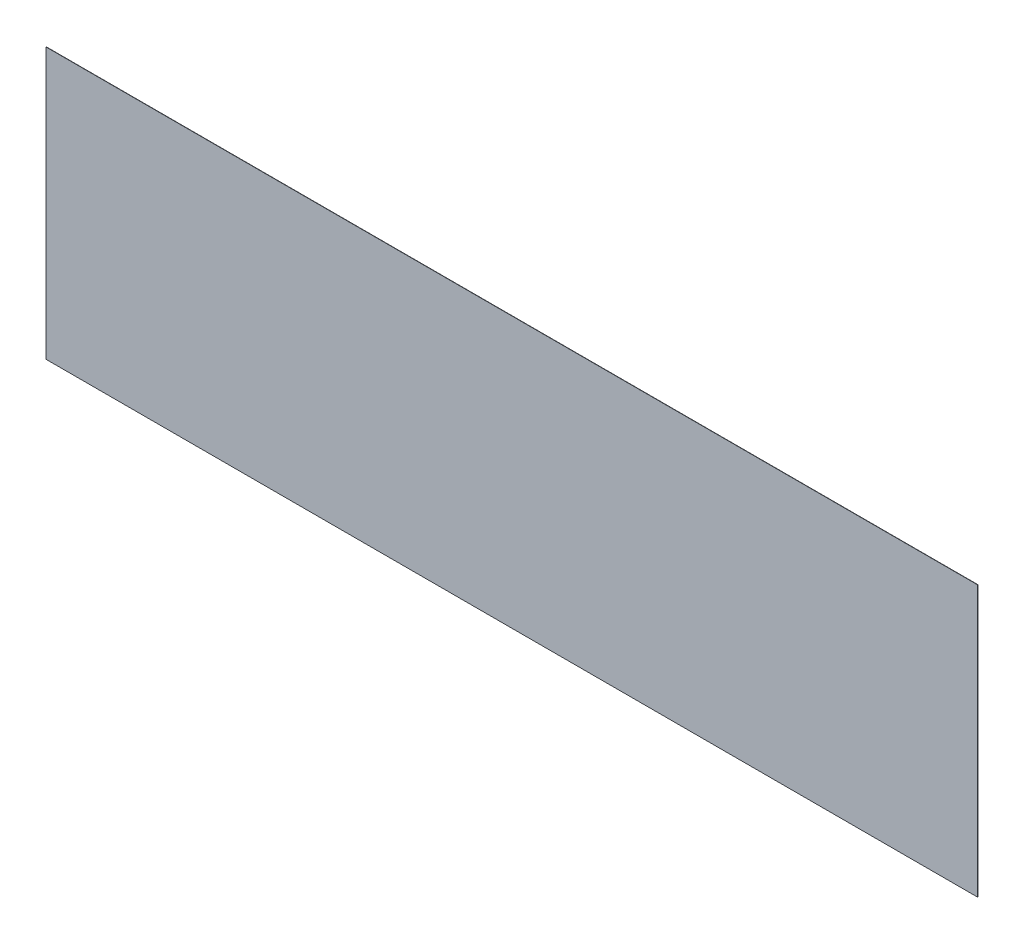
ISO-10303-21;
HEADER;
FILE_DESCRIPTION(('STEP AP214'),'2;1');
FILE_NAME('part.step','',(''),(''),'','','');
FILE_SCHEMA(('AUTOMOTIVE_DESIGN { 1 0 10303 214 1 1 1 1 }'));
ENDSEC;
DATA;
#1=APPLICATION_CONTEXT('core data for automotive mechanical design processes');
#2=APPLICATION_PROTOCOL_DEFINITION('international standard','automotive_design',2000,#1);
#3=PRODUCT_CONTEXT('',#1,'mechanical');
#4=PRODUCT('Part','Part','',(#3));
#5=PRODUCT_RELATED_PRODUCT_CATEGORY('part','',(#4));
#6=PRODUCT_DEFINITION_FORMATION('','',#4);
#7=PRODUCT_DEFINITION_CONTEXT('part definition',#1,'design');
#8=PRODUCT_DEFINITION('design','',#6,#7);
#9=PRODUCT_DEFINITION_SHAPE('','',#8);
#10=(LENGTH_UNIT() NAMED_UNIT(*) SI_UNIT(.MILLI.,.METRE.));
#11=(NAMED_UNIT(*) PLANE_ANGLE_UNIT() SI_UNIT($,.RADIAN.));
#12=(NAMED_UNIT(*) SI_UNIT($,.STERADIAN.) SOLID_ANGLE_UNIT());
#13=UNCERTAINTY_MEASURE_WITH_UNIT(LENGTH_MEASURE(1.E-05),#10,'distance_accuracy_value','');
#14=(GEOMETRIC_REPRESENTATION_CONTEXT(3) GLOBAL_UNCERTAINTY_ASSIGNED_CONTEXT((#13)) GLOBAL_UNIT_ASSIGNED_CONTEXT((#10,
#11,#12)) REPRESENTATION_CONTEXT('',''));
#15=CARTESIAN_POINT('',(0.,0.,0.));
#16=DIRECTION('',(0.,0.,1.));
#17=DIRECTION('',(1.,0.,0.));
#18=AXIS2_PLACEMENT_3D('',#15,#16,#17);
#19=CARTESIAN_POINT('',(0.,0.,0.01));
#20=DIRECTION('',(0.,0.,1.));
#21=DIRECTION('',(1.,0.,0.));
#22=AXIS2_PLACEMENT_3D('',#19,#20,#21);
#23=PLANE('',#22);
#24=DIRECTION('',(1.,0.,0.));
#25=VECTOR('',#24,1.);
#26=CARTESIAN_POINT('',(31.,9.,0.01));
#27=LINE('',#26,#25);
#28=CARTESIAN_POINT('',(0.,9.,0.01));
#29=VERTEX_POINT('',#28);
#30=CARTESIAN_POINT('',(31.,9.,0.01));
#31=VERTEX_POINT('',#30);
#32=EDGE_CURVE('E67',#29,#31,#27,.T.);
#33=ORIENTED_EDGE('',*,*,#32,.F.);
#34=DIRECTION('',(0.,1.,0.));
#35=VECTOR('',#34,1.);
#36=CARTESIAN_POINT('',(0.,9.,0.01));
#37=LINE('',#36,#35);
#38=CARTESIAN_POINT('',(0.,0.,0.01));
#39=VERTEX_POINT('',#38);
#40=EDGE_CURVE('E19',#39,#29,#37,.T.);
#41=ORIENTED_EDGE('',*,*,#40,.F.);
#42=DIRECTION('',(1.,0.,0.));
#43=VECTOR('',#42,1.);
#44=CARTESIAN_POINT('',(0.,0.,0.01));
#45=LINE('',#44,#43);
#46=CARTESIAN_POINT('',(31.,0.,0.01));
#47=VERTEX_POINT('',#46);
#48=EDGE_CURVE('E57',#47,#39,#45,.F.);
#49=ORIENTED_EDGE('',*,*,#48,.F.);
#50=DIRECTION('',(0.,1.,0.));
#51=VECTOR('',#50,1.);
#52=CARTESIAN_POINT('',(31.,0.,0.01));
#53=LINE('',#52,#51);
#54=EDGE_CURVE('E52',#31,#47,#53,.F.);
#55=ORIENTED_EDGE('',*,*,#54,.F.);
#56=EDGE_LOOP('',(#33,#41,#49,#55));
#57=FACE_BOUND('',#56,.T.);
#58=ADVANCED_FACE('F16',(#57),#23,.T.);
#59=CARTESIAN_POINT('',(0.,9.,0.));
#60=DIRECTION('',(-1.,0.,0.));
#61=DIRECTION('',(0.,0.,1.));
#62=AXIS2_PLACEMENT_3D('',#59,#60,#61);
#63=PLANE('',#62);
#64=DIRECTION('',(0.,0.,1.));
#65=VECTOR('',#64,1.);
#66=CARTESIAN_POINT('',(0.,9.,0.));
#67=LINE('',#66,#65);
#68=CARTESIAN_POINT('',(0.,9.,0.));
#69=VERTEX_POINT('',#68);
#70=EDGE_CURVE('E78',#69,#29,#67,.T.);
#71=ORIENTED_EDGE('',*,*,#70,.F.);
#72=DIRECTION('',(0.,1.,0.));
#73=VECTOR('',#72,1.);
#74=CARTESIAN_POINT('',(0.,0.,0.));
#75=LINE('',#74,#73);
#76=CARTESIAN_POINT('',(0.,0.,0.));
#77=VERTEX_POINT('',#76);
#78=EDGE_CURVE('E73',#69,#77,#75,.F.);
#79=ORIENTED_EDGE('',*,*,#78,.T.);
#80=DIRECTION('',(0.,0.,-1.));
#81=VECTOR('',#80,1.);
#82=CARTESIAN_POINT('',(0.,0.,0.));
#83=LINE('',#82,#81);
#84=EDGE_CURVE('E62',#39,#77,#83,.T.);
#85=ORIENTED_EDGE('',*,*,#84,.F.);
#86=ORIENTED_EDGE('',*,*,#40,.T.);
#87=EDGE_LOOP('',(#71,#79,#85,#86));
#88=FACE_BOUND('',#87,.T.);
#89=ADVANCED_FACE('F72',(#88),#63,.T.);
#90=CARTESIAN_POINT('',(0.,0.,0.));
#91=DIRECTION('',(0.,-1.,0.));
#92=DIRECTION('',(0.,0.,-1.));
#93=AXIS2_PLACEMENT_3D('',#90,#91,#92);
#94=PLANE('',#93);
#95=ORIENTED_EDGE('',*,*,#84,.T.);
#96=DIRECTION('',(1.,0.,0.));
#97=VECTOR('',#96,1.);
#98=CARTESIAN_POINT('',(0.,0.,0.));
#99=LINE('',#98,#97);
#100=CARTESIAN_POINT('',(31.,0.,0.));
#101=VERTEX_POINT('',#100);
#102=EDGE_CURVE('E83',#77,#101,#99,.T.);
#103=ORIENTED_EDGE('',*,*,#102,.T.);
#104=DIRECTION('',(0.,0.,-1.));
#105=VECTOR('',#104,1.);
#106=CARTESIAN_POINT('',(31.,0.,0.));
#107=LINE('',#106,#105);
#108=EDGE_CURVE('E64',#47,#101,#107,.T.);
#109=ORIENTED_EDGE('',*,*,#108,.F.);
#110=ORIENTED_EDGE('',*,*,#48,.T.);
#111=EDGE_LOOP('',(#95,#103,#109,#110));
#112=FACE_BOUND('',#111,.T.);
#113=ADVANCED_FACE('F59',(#112),#94,.T.);
#114=CARTESIAN_POINT('',(31.,0.,0.));
#115=DIRECTION('',(1.,0.,0.));
#116=DIRECTION('',(0.,0.,-1.));
#117=AXIS2_PLACEMENT_3D('',#114,#115,#116);
#118=PLANE('',#117);
#119=ORIENTED_EDGE('',*,*,#108,.T.);
#120=DIRECTION('',(0.,1.,0.));
#121=VECTOR('',#120,1.);
#122=CARTESIAN_POINT('',(31.,0.,0.));
#123=LINE('',#122,#121);
#124=CARTESIAN_POINT('',(31.,9.,0.));
#125=VERTEX_POINT('',#124);
#126=EDGE_CURVE('E25',#101,#125,#123,.T.);
#127=ORIENTED_EDGE('',*,*,#126,.T.);
#128=DIRECTION('',(0.,0.,1.));
#129=VECTOR('',#128,1.);
#130=CARTESIAN_POINT('',(31.,9.,0.));
#131=LINE('',#130,#129);
#132=EDGE_CURVE('E33',#31,#125,#131,.F.);
#133=ORIENTED_EDGE('',*,*,#132,.F.);
#134=ORIENTED_EDGE('',*,*,#54,.T.);
#135=EDGE_LOOP('',(#119,#127,#133,#134));
#136=FACE_BOUND('',#135,.T.);
#137=ADVANCED_FACE('F87',(#136),#118,.T.);
#138=CARTESIAN_POINT('',(31.,9.,0.));
#139=DIRECTION('',(0.,1.,0.));
#140=DIRECTION('',(0.,0.,1.));
#141=AXIS2_PLACEMENT_3D('',#138,#139,#140);
#142=PLANE('',#141);
#143=ORIENTED_EDGE('',*,*,#132,.T.);
#144=DIRECTION('',(1.,0.,0.));
#145=VECTOR('',#144,1.);
#146=CARTESIAN_POINT('',(0.,9.,0.));
#147=LINE('',#146,#145);
#148=EDGE_CURVE('E11',#125,#69,#147,.F.);
#149=ORIENTED_EDGE('',*,*,#148,.T.);
#150=ORIENTED_EDGE('',*,*,#70,.T.);
#151=ORIENTED_EDGE('',*,*,#32,.T.);
#152=EDGE_LOOP('',(#143,#149,#150,#151));
#153=FACE_BOUND('',#152,.T.);
#154=ADVANCED_FACE('F90',(#153),#142,.T.);
#155=CARTESIAN_POINT('',(0.,0.,0.));
#156=DIRECTION('',(0.,0.,1.));
#157=DIRECTION('',(1.,0.,0.));
#158=AXIS2_PLACEMENT_3D('',#155,#156,#157);
#159=PLANE('',#158);
#160=ORIENTED_EDGE('',*,*,#126,.F.);
#161=ORIENTED_EDGE('',*,*,#102,.F.);
#162=ORIENTED_EDGE('',*,*,#78,.F.);
#163=ORIENTED_EDGE('',*,*,#148,.F.);
#164=EDGE_LOOP('',(#160,#161,#162,#163));
#165=FACE_BOUND('',#164,.T.);
#166=ADVANCED_FACE('F89',(#165),#159,.F.);
#167=CLOSED_SHELL('',(#58,#89,#113,#137,#154,#166));
#168=MANIFOLD_SOLID_BREP('B1',#167);
#169=ADVANCED_BREP_SHAPE_REPRESENTATION('',(#18,#168),#14);
#170=SHAPE_DEFINITION_REPRESENTATION(#9,#169);
ENDSEC;
END-ISO-10303-21;
